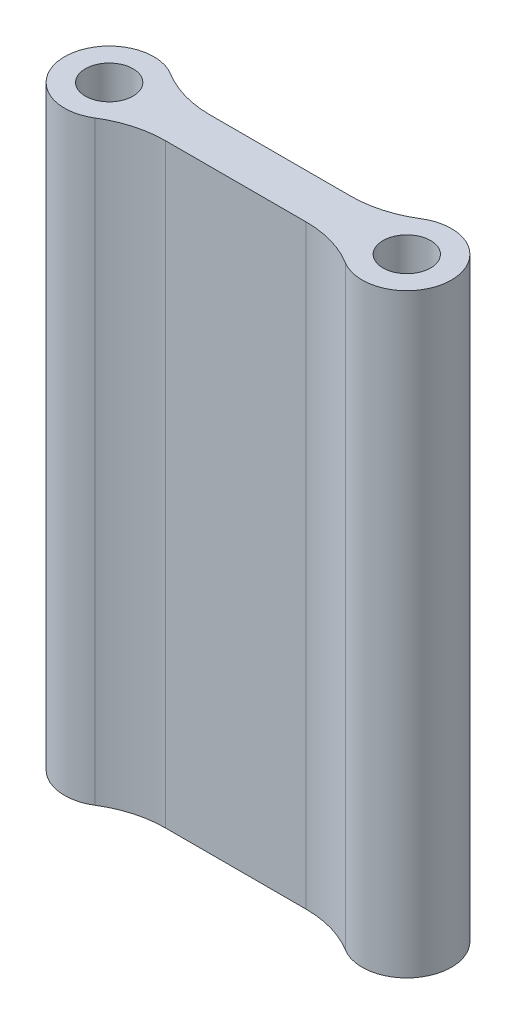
ISO-10303-21;
HEADER;
FILE_DESCRIPTION(('STEP AP214'),'2;1');
FILE_NAME('part.step','',(''),(''),'','','');
FILE_SCHEMA(('AUTOMOTIVE_DESIGN { 1 0 10303 214 1 1 1 1 }'));
ENDSEC;
DATA;
#1=APPLICATION_CONTEXT('core data for automotive mechanical design processes');
#2=APPLICATION_PROTOCOL_DEFINITION('international standard','automotive_design',2000,#1);
#3=PRODUCT_CONTEXT('',#1,'mechanical');
#4=PRODUCT('Part','Part','',(#3));
#5=PRODUCT_RELATED_PRODUCT_CATEGORY('part','',(#4));
#6=PRODUCT_DEFINITION_FORMATION('','',#4);
#7=PRODUCT_DEFINITION_CONTEXT('part definition',#1,'design');
#8=PRODUCT_DEFINITION('design','',#6,#7);
#9=PRODUCT_DEFINITION_SHAPE('','',#8);
#10=(LENGTH_UNIT() NAMED_UNIT(*) SI_UNIT(.MILLI.,.METRE.));
#11=(NAMED_UNIT(*) PLANE_ANGLE_UNIT() SI_UNIT($,.RADIAN.));
#12=(NAMED_UNIT(*) SI_UNIT($,.STERADIAN.) SOLID_ANGLE_UNIT());
#13=UNCERTAINTY_MEASURE_WITH_UNIT(LENGTH_MEASURE(1.E-05),#10,'distance_accuracy_value','');
#14=(GEOMETRIC_REPRESENTATION_CONTEXT(3) GLOBAL_UNCERTAINTY_ASSIGNED_CONTEXT((#13)) GLOBAL_UNIT_ASSIGNED_CONTEXT((#10,
#11,#12)) REPRESENTATION_CONTEXT('',''));
#15=CARTESIAN_POINT('',(0.,0.,0.));
#16=DIRECTION('',(0.,0.,1.));
#17=DIRECTION('',(1.,0.,0.));
#18=AXIS2_PLACEMENT_3D('',#15,#16,#17);
#19=CARTESIAN_POINT('',(5.26782687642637,40.,8.5));
#20=DIRECTION('',(0.,-1.,0.));
#21=DIRECTION('',(0.,0.,-1.));
#22=AXIS2_PLACEMENT_3D('',#19,#20,#21);
#23=PLANE('',#22);
#24=CARTESIAN_POINT('',(5.26782687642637,40.,8.5));
#25=DIRECTION('',(0.,-1.,0.));
#26=DIRECTION('',(0.,0.,-1.));
#27=AXIS2_PLACEMENT_3D('',#24,#25,#26);
#28=CIRCLE('',#27,7.);
#29=CARTESIAN_POINT('',(1.58034806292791,40.,2.55));
#30=VERTEX_POINT('',#29);
#31=CARTESIAN_POINT('',(5.26782687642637,40.,1.5));
#32=VERTEX_POINT('',#31);
#33=EDGE_CURVE('E153',#30,#32,#28,.T.);
#34=ORIENTED_EDGE('',*,*,#33,.T.);
#35=DIRECTION('',(1.,0.,0.));
#36=VECTOR('',#35,1.);
#37=CARTESIAN_POINT('',(14.7321731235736,40.,1.5));
#38=LINE('',#37,#36);
#39=CARTESIAN_POINT('',(14.7321731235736,40.,1.5));
#40=VERTEX_POINT('',#39);
#41=EDGE_CURVE('E101',#32,#40,#38,.T.);
#42=ORIENTED_EDGE('',*,*,#41,.T.);
#43=CARTESIAN_POINT('',(14.7321731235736,40.,8.5));
#44=DIRECTION('',(0.,-1.,0.));
#45=DIRECTION('',(0.,0.,1.));
#46=AXIS2_PLACEMENT_3D('',#43,#44,#45);
#47=CIRCLE('',#46,7.);
#48=CARTESIAN_POINT('',(18.4196519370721,40.,2.55));
#49=VERTEX_POINT('',#48);
#50=EDGE_CURVE('E168',#40,#49,#47,.T.);
#51=ORIENTED_EDGE('',*,*,#50,.T.);
#52=CARTESIAN_POINT('',(20.,40.,0.));
#53=DIRECTION('',(0.,1.,0.));
#54=DIRECTION('',(0.,0.,-1.));
#55=AXIS2_PLACEMENT_3D('',#52,#53,#54);
#56=CIRCLE('',#55,3.);
#57=CARTESIAN_POINT('',(18.4196519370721,40.,-2.55));
#58=VERTEX_POINT('',#57);
#59=EDGE_CURVE('E181',#49,#58,#56,.T.);
#60=ORIENTED_EDGE('',*,*,#59,.T.);
#61=CARTESIAN_POINT('',(14.7321731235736,40.,-8.5));
#62=DIRECTION('',(0.,-1.,0.));
#63=DIRECTION('',(0.,0.,-1.));
#64=AXIS2_PLACEMENT_3D('',#61,#62,#63);
#65=CIRCLE('',#64,7.);
#66=CARTESIAN_POINT('',(14.7321731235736,40.,-1.5));
#67=VERTEX_POINT('',#66);
#68=EDGE_CURVE('E120',#58,#67,#65,.T.);
#69=ORIENTED_EDGE('',*,*,#68,.T.);
#70=DIRECTION('',(-1.,0.,0.));
#71=VECTOR('',#70,1.);
#72=CARTESIAN_POINT('',(5.26782687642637,40.,-1.5));
#73=LINE('',#72,#71);
#74=CARTESIAN_POINT('',(5.26782687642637,40.,-1.5));
#75=VERTEX_POINT('',#74);
#76=EDGE_CURVE('E114',#67,#75,#73,.T.);
#77=ORIENTED_EDGE('',*,*,#76,.T.);
#78=CARTESIAN_POINT('',(5.26782687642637,40.,-8.5));
#79=DIRECTION('',(0.,-1.,0.));
#80=DIRECTION('',(0.,0.,1.));
#81=AXIS2_PLACEMENT_3D('',#78,#79,#80);
#82=CIRCLE('',#81,7.);
#83=CARTESIAN_POINT('',(1.58034806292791,40.,-2.55));
#84=VERTEX_POINT('',#83);
#85=EDGE_CURVE('E118',#75,#84,#82,.T.);
#86=ORIENTED_EDGE('',*,*,#85,.T.);
#87=CARTESIAN_POINT('',(0.,40.,0.));
#88=DIRECTION('',(0.,1.,0.));
#89=DIRECTION('',(0.,0.,-1.));
#90=AXIS2_PLACEMENT_3D('',#87,#88,#89);
#91=CIRCLE('',#90,3.);
#92=EDGE_CURVE('E58',#84,#30,#91,.T.);
#93=ORIENTED_EDGE('',*,*,#92,.T.);
#94=EDGE_LOOP('',(#34,#42,#51,#60,#69,#77,#86,#93));
#95=FACE_BOUND('',#94,.T.);
#96=CARTESIAN_POINT('',(0.,40.,0.));
#97=DIRECTION('',(0.,1.,0.));
#98=DIRECTION('',(0.,0.,1.));
#99=AXIS2_PLACEMENT_3D('',#96,#97,#98);
#100=CIRCLE('',#99,1.6);
#101=CARTESIAN_POINT('',(0.,40.,1.6));
#102=VERTEX_POINT('',#101);
#103=EDGE_CURVE('E142',#102,#102,#100,.T.);
#104=ORIENTED_EDGE('',*,*,#103,.F.);
#105=EDGE_LOOP('',(#104));
#106=FACE_BOUND('',#105,.T.);
#107=CARTESIAN_POINT('',(20.,40.,0.));
#108=DIRECTION('',(0.,1.,0.));
#109=DIRECTION('',(0.,0.,1.));
#110=AXIS2_PLACEMENT_3D('',#107,#108,#109);
#111=CIRCLE('',#110,1.6);
#112=CARTESIAN_POINT('',(20.,40.,1.6));
#113=VERTEX_POINT('',#112);
#114=EDGE_CURVE('E190',#113,#113,#111,.T.);
#115=ORIENTED_EDGE('',*,*,#114,.F.);
#116=EDGE_LOOP('',(#115));
#117=FACE_BOUND('',#116,.T.);
#118=ADVANCED_FACE('F41',(#95,#106,#117),#23,.F.);
#119=CARTESIAN_POINT('',(5.26782687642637,0.,8.5));
#120=DIRECTION('',(0.,-1.,0.));
#121=DIRECTION('',(0.,0.,-1.));
#122=AXIS2_PLACEMENT_3D('',#119,#120,#121);
#123=PLANE('',#122);
#124=CARTESIAN_POINT('',(0.,0.,0.));
#125=DIRECTION('',(0.,1.,0.));
#126=DIRECTION('',(0.,0.,1.));
#127=AXIS2_PLACEMENT_3D('',#124,#125,#126);
#128=CIRCLE('',#127,1.6);
#129=CARTESIAN_POINT('',(0.,0.,1.6));
#130=VERTEX_POINT('',#129);
#131=EDGE_CURVE('E187',#130,#130,#128,.T.);
#132=ORIENTED_EDGE('',*,*,#131,.T.);
#133=EDGE_LOOP('',(#132));
#134=FACE_BOUND('',#133,.T.);
#135=CARTESIAN_POINT('',(5.26782687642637,0.,8.5));
#136=DIRECTION('',(0.,-1.,0.));
#137=DIRECTION('',(0.,0.,-1.));
#138=AXIS2_PLACEMENT_3D('',#135,#136,#137);
#139=CIRCLE('',#138,7.);
#140=CARTESIAN_POINT('',(1.58034806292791,0.,2.55));
#141=VERTEX_POINT('',#140);
#142=CARTESIAN_POINT('',(5.26782687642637,0.,1.5));
#143=VERTEX_POINT('',#142);
#144=EDGE_CURVE('E138',#141,#143,#139,.T.);
#145=ORIENTED_EDGE('',*,*,#144,.F.);
#146=CARTESIAN_POINT('',(0.,0.,0.));
#147=DIRECTION('',(0.,1.,0.));
#148=DIRECTION('',(0.,0.,-1.));
#149=AXIS2_PLACEMENT_3D('',#146,#147,#148);
#150=CIRCLE('',#149,3.);
#151=CARTESIAN_POINT('',(1.58034806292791,0.,-2.55));
#152=VERTEX_POINT('',#151);
#153=EDGE_CURVE('E93',#152,#141,#150,.T.);
#154=ORIENTED_EDGE('',*,*,#153,.F.);
#155=CARTESIAN_POINT('',(5.26782687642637,0.,-8.5));
#156=DIRECTION('',(0.,-1.,0.));
#157=DIRECTION('',(0.,0.,1.));
#158=AXIS2_PLACEMENT_3D('',#155,#156,#157);
#159=CIRCLE('',#158,7.);
#160=CARTESIAN_POINT('',(5.26782687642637,0.,-1.5));
#161=VERTEX_POINT('',#160);
#162=EDGE_CURVE('E87',#161,#152,#159,.T.);
#163=ORIENTED_EDGE('',*,*,#162,.F.);
#164=DIRECTION('',(-1.,0.,0.));
#165=VECTOR('',#164,1.);
#166=CARTESIAN_POINT('',(5.26782687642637,0.,-1.5));
#167=LINE('',#166,#165);
#168=CARTESIAN_POINT('',(14.7321731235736,0.,-1.5));
#169=VERTEX_POINT('',#168);
#170=EDGE_CURVE('E128',#169,#161,#167,.T.);
#171=ORIENTED_EDGE('',*,*,#170,.F.);
#172=CARTESIAN_POINT('',(14.7321731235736,0.,-8.5));
#173=DIRECTION('',(0.,-1.,0.));
#174=DIRECTION('',(0.,0.,-1.));
#175=AXIS2_PLACEMENT_3D('',#172,#173,#174);
#176=CIRCLE('',#175,7.);
#177=CARTESIAN_POINT('',(18.4196519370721,0.,-2.55));
#178=VERTEX_POINT('',#177);
#179=EDGE_CURVE('E148',#178,#169,#176,.T.);
#180=ORIENTED_EDGE('',*,*,#179,.F.);
#181=CARTESIAN_POINT('',(20.,0.,0.));
#182=DIRECTION('',(0.,1.,0.));
#183=DIRECTION('',(0.,0.,-1.));
#184=AXIS2_PLACEMENT_3D('',#181,#182,#183);
#185=CIRCLE('',#184,3.);
#186=CARTESIAN_POINT('',(18.4196519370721,0.,2.55));
#187=VERTEX_POINT('',#186);
#188=EDGE_CURVE('E146',#187,#178,#185,.T.);
#189=ORIENTED_EDGE('',*,*,#188,.F.);
#190=CARTESIAN_POINT('',(14.7321731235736,0.,8.5));
#191=DIRECTION('',(0.,-1.,0.));
#192=DIRECTION('',(0.,0.,1.));
#193=AXIS2_PLACEMENT_3D('',#190,#191,#192);
#194=CIRCLE('',#193,7.);
#195=CARTESIAN_POINT('',(14.7321731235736,0.,1.5));
#196=VERTEX_POINT('',#195);
#197=EDGE_CURVE('E144',#196,#187,#194,.T.);
#198=ORIENTED_EDGE('',*,*,#197,.F.);
#199=DIRECTION('',(1.,0.,0.));
#200=VECTOR('',#199,1.);
#201=CARTESIAN_POINT('',(14.7321731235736,0.,1.5));
#202=LINE('',#201,#200);
#203=EDGE_CURVE('E141',#143,#196,#202,.T.);
#204=ORIENTED_EDGE('',*,*,#203,.F.);
#205=EDGE_LOOP('',(#145,#154,#163,#171,#180,#189,#198,#204));
#206=FACE_BOUND('',#205,.T.);
#207=CARTESIAN_POINT('',(20.,0.,0.));
#208=DIRECTION('',(0.,1.,0.));
#209=DIRECTION('',(0.,0.,1.));
#210=AXIS2_PLACEMENT_3D('',#207,#208,#209);
#211=CIRCLE('',#210,1.6);
#212=CARTESIAN_POINT('',(20.,0.,1.6));
#213=VERTEX_POINT('',#212);
#214=EDGE_CURVE('E193',#213,#213,#211,.T.);
#215=ORIENTED_EDGE('',*,*,#214,.T.);
#216=EDGE_LOOP('',(#215));
#217=FACE_BOUND('',#216,.T.);
#218=ADVANCED_FACE('F172',(#134,#206,#217),#123,.T.);
#219=CARTESIAN_POINT('',(5.26782687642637,40.,8.5));
#220=DIRECTION('',(0.,-1.,0.));
#221=DIRECTION('',(0.,0.,-1.));
#222=AXIS2_PLACEMENT_3D('',#219,#220,#221);
#223=CYLINDRICAL_SURFACE('',#222,7.);
#224=ORIENTED_EDGE('',*,*,#144,.T.);
#225=DIRECTION('',(0.,-1.,0.));
#226=VECTOR('',#225,1.);
#227=CARTESIAN_POINT('',(5.26782687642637,40.,1.5));
#228=LINE('',#227,#226);
#229=EDGE_CURVE('E11',#32,#143,#228,.T.);
#230=ORIENTED_EDGE('',*,*,#229,.F.);
#231=ORIENTED_EDGE('',*,*,#33,.F.);
#232=DIRECTION('',(0.,-1.,0.));
#233=VECTOR('',#232,1.);
#234=CARTESIAN_POINT('',(1.58034806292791,40.,2.55));
#235=LINE('',#234,#233);
#236=EDGE_CURVE('E134',#30,#141,#235,.T.);
#237=ORIENTED_EDGE('',*,*,#236,.T.);
#238=EDGE_LOOP('',(#224,#230,#231,#237));
#239=FACE_BOUND('',#238,.T.);
#240=ADVANCED_FACE('F43',(#239),#223,.F.);
#241=CARTESIAN_POINT('',(14.7321731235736,40.,1.5));
#242=DIRECTION('',(0.,0.,-1.));
#243=DIRECTION('',(-1.,0.,0.));
#244=AXIS2_PLACEMENT_3D('',#241,#242,#243);
#245=PLANE('',#244);
#246=ORIENTED_EDGE('',*,*,#203,.T.);
#247=DIRECTION('',(0.,-1.,0.));
#248=VECTOR('',#247,1.);
#249=CARTESIAN_POINT('',(14.7321731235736,40.,1.5));
#250=LINE('',#249,#248);
#251=EDGE_CURVE('E50',#40,#196,#250,.T.);
#252=ORIENTED_EDGE('',*,*,#251,.F.);
#253=ORIENTED_EDGE('',*,*,#41,.F.);
#254=ORIENTED_EDGE('',*,*,#229,.T.);
#255=EDGE_LOOP('',(#246,#252,#253,#254));
#256=FACE_BOUND('',#255,.T.);
#257=ADVANCED_FACE('F225',(#256),#245,.F.);
#258=CARTESIAN_POINT('',(14.7321731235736,40.,8.5));
#259=DIRECTION('',(0.,-1.,0.));
#260=DIRECTION('',(0.,0.,-1.));
#261=AXIS2_PLACEMENT_3D('',#258,#259,#260);
#262=CYLINDRICAL_SURFACE('',#261,7.);
#263=ORIENTED_EDGE('',*,*,#197,.T.);
#264=DIRECTION('',(0.,-1.,0.));
#265=VECTOR('',#264,1.);
#266=CARTESIAN_POINT('',(18.4196519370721,40.,2.55));
#267=LINE('',#266,#265);
#268=EDGE_CURVE('E160',#49,#187,#267,.T.);
#269=ORIENTED_EDGE('',*,*,#268,.F.);
#270=ORIENTED_EDGE('',*,*,#50,.F.);
#271=ORIENTED_EDGE('',*,*,#251,.T.);
#272=EDGE_LOOP('',(#263,#269,#270,#271));
#273=FACE_BOUND('',#272,.T.);
#274=ADVANCED_FACE('F166',(#273),#262,.F.);
#275=CARTESIAN_POINT('',(20.,40.,0.));
#276=DIRECTION('',(0.,-1.,0.));
#277=DIRECTION('',(0.,0.,-1.));
#278=AXIS2_PLACEMENT_3D('',#275,#276,#277);
#279=CYLINDRICAL_SURFACE('',#278,3.);
#280=ORIENTED_EDGE('',*,*,#188,.T.);
#281=DIRECTION('',(0.,-1.,0.));
#282=VECTOR('',#281,1.);
#283=CARTESIAN_POINT('',(18.4196519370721,40.,-2.55));
#284=LINE('',#283,#282);
#285=EDGE_CURVE('E157',#58,#178,#284,.T.);
#286=ORIENTED_EDGE('',*,*,#285,.F.);
#287=ORIENTED_EDGE('',*,*,#59,.F.);
#288=ORIENTED_EDGE('',*,*,#268,.T.);
#289=EDGE_LOOP('',(#280,#286,#287,#288));
#290=FACE_BOUND('',#289,.T.);
#291=ADVANCED_FACE('F177',(#290),#279,.T.);
#292=CARTESIAN_POINT('',(14.7321731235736,40.,-8.5));
#293=DIRECTION('',(0.,-1.,0.));
#294=DIRECTION('',(0.,0.,-1.));
#295=AXIS2_PLACEMENT_3D('',#292,#293,#294);
#296=CYLINDRICAL_SURFACE('',#295,7.);
#297=ORIENTED_EDGE('',*,*,#179,.T.);
#298=DIRECTION('',(0.,-1.,0.));
#299=VECTOR('',#298,1.);
#300=CARTESIAN_POINT('',(14.7321731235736,40.,-1.5));
#301=LINE('',#300,#299);
#302=EDGE_CURVE('E129',#67,#169,#301,.T.);
#303=ORIENTED_EDGE('',*,*,#302,.F.);
#304=ORIENTED_EDGE('',*,*,#68,.F.);
#305=ORIENTED_EDGE('',*,*,#285,.T.);
#306=EDGE_LOOP('',(#297,#303,#304,#305));
#307=FACE_BOUND('',#306,.T.);
#308=ADVANCED_FACE('F180',(#307),#296,.F.);
#309=CARTESIAN_POINT('',(5.26782687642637,40.,-1.5));
#310=DIRECTION('',(0.,0.,1.));
#311=DIRECTION('',(1.,0.,0.));
#312=AXIS2_PLACEMENT_3D('',#309,#310,#311);
#313=PLANE('',#312);
#314=ORIENTED_EDGE('',*,*,#170,.T.);
#315=DIRECTION('',(0.,-1.,0.));
#316=VECTOR('',#315,1.);
#317=CARTESIAN_POINT('',(5.26782687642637,40.,-1.5));
#318=LINE('',#317,#316);
#319=EDGE_CURVE('E125',#75,#161,#318,.T.);
#320=ORIENTED_EDGE('',*,*,#319,.F.);
#321=ORIENTED_EDGE('',*,*,#76,.F.);
#322=ORIENTED_EDGE('',*,*,#302,.T.);
#323=EDGE_LOOP('',(#314,#320,#321,#322));
#324=FACE_BOUND('',#323,.T.);
#325=ADVANCED_FACE('F126',(#324),#313,.F.);
#326=CARTESIAN_POINT('',(5.26782687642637,40.,-8.5));
#327=DIRECTION('',(0.,-1.,0.));
#328=DIRECTION('',(0.,0.,-1.));
#329=AXIS2_PLACEMENT_3D('',#326,#327,#328);
#330=CYLINDRICAL_SURFACE('',#329,7.);
#331=ORIENTED_EDGE('',*,*,#162,.T.);
#332=DIRECTION('',(0.,-1.,0.));
#333=VECTOR('',#332,1.);
#334=CARTESIAN_POINT('',(1.58034806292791,40.,-2.55));
#335=LINE('',#334,#333);
#336=EDGE_CURVE('E130',#84,#152,#335,.T.);
#337=ORIENTED_EDGE('',*,*,#336,.F.);
#338=ORIENTED_EDGE('',*,*,#85,.F.);
#339=ORIENTED_EDGE('',*,*,#319,.T.);
#340=EDGE_LOOP('',(#331,#337,#338,#339));
#341=FACE_BOUND('',#340,.T.);
#342=ADVANCED_FACE('F132',(#341),#330,.F.);
#343=CARTESIAN_POINT('',(0.,40.,0.));
#344=DIRECTION('',(0.,-1.,0.));
#345=DIRECTION('',(0.,0.,-1.));
#346=AXIS2_PLACEMENT_3D('',#343,#344,#345);
#347=CYLINDRICAL_SURFACE('',#346,3.);
#348=ORIENTED_EDGE('',*,*,#153,.T.);
#349=ORIENTED_EDGE('',*,*,#236,.F.);
#350=ORIENTED_EDGE('',*,*,#92,.F.);
#351=ORIENTED_EDGE('',*,*,#336,.T.);
#352=EDGE_LOOP('',(#348,#349,#350,#351));
#353=FACE_BOUND('',#352,.T.);
#354=ADVANCED_FACE('F213',(#353),#347,.T.);
#355=CARTESIAN_POINT('',(0.,40.,0.));
#356=DIRECTION('',(0.,-1.,0.));
#357=DIRECTION('',(0.,0.,-1.));
#358=AXIS2_PLACEMENT_3D('',#355,#356,#357);
#359=CYLINDRICAL_SURFACE('',#358,1.6);
#360=ORIENTED_EDGE('',*,*,#103,.T.);
#361=EDGE_LOOP('',(#360));
#362=FACE_BOUND('',#361,.T.);
#363=ORIENTED_EDGE('',*,*,#131,.F.);
#364=EDGE_LOOP('',(#363));
#365=FACE_BOUND('',#364,.T.);
#366=ADVANCED_FACE('F210',(#362,#365),#359,.F.);
#367=CARTESIAN_POINT('',(20.,40.,0.));
#368=DIRECTION('',(0.,-1.,0.));
#369=DIRECTION('',(0.,0.,-1.));
#370=AXIS2_PLACEMENT_3D('',#367,#368,#369);
#371=CYLINDRICAL_SURFACE('',#370,1.6);
#372=ORIENTED_EDGE('',*,*,#114,.T.);
#373=EDGE_LOOP('',(#372));
#374=FACE_BOUND('',#373,.T.);
#375=ORIENTED_EDGE('',*,*,#214,.F.);
#376=EDGE_LOOP('',(#375));
#377=FACE_BOUND('',#376,.T.);
#378=ADVANCED_FACE('F199',(#374,#377),#371,.F.);
#379=CLOSED_SHELL('',(#118,#218,#240,#257,#274,#291,#308,#325,#342,#354,#366,#378));
#380=MANIFOLD_SOLID_BREP('B2',#379);
#381=ADVANCED_BREP_SHAPE_REPRESENTATION('',(#18,#380),#14);
#382=SHAPE_DEFINITION_REPRESENTATION(#9,#381);
ENDSEC;
END-ISO-10303-21;
